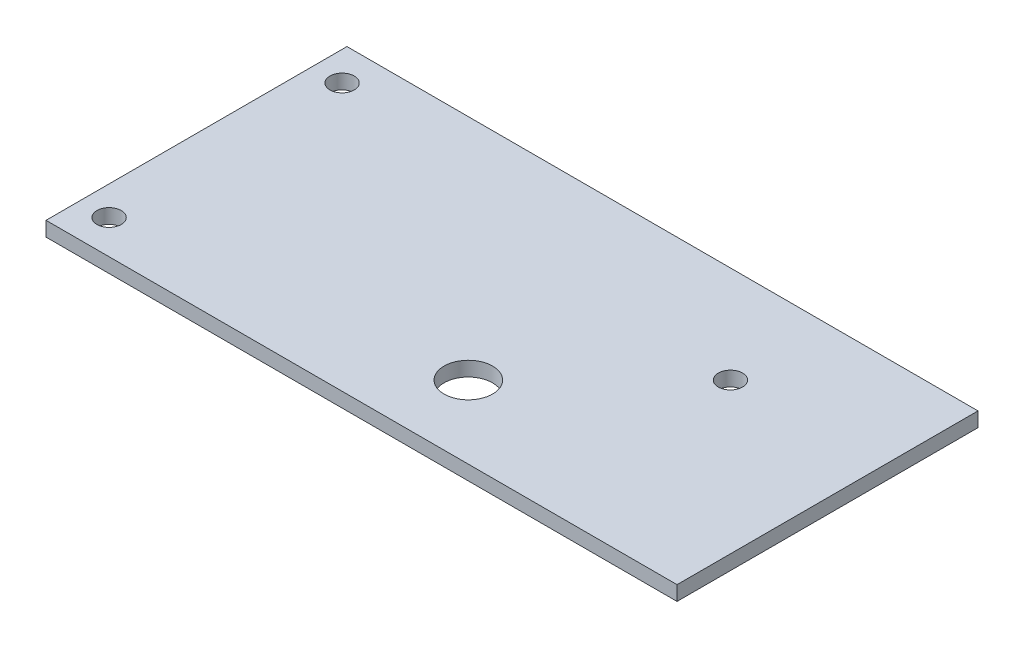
ISO-10303-21;
HEADER;
FILE_DESCRIPTION(('STEP AP214'),'2;1');
FILE_NAME('part.step','',(''),(''),'','','');
FILE_SCHEMA(('AUTOMOTIVE_DESIGN { 1 0 10303 214 1 1 1 1 }'));
ENDSEC;
DATA;
#1=APPLICATION_CONTEXT('core data for automotive mechanical design processes');
#2=APPLICATION_PROTOCOL_DEFINITION('international standard','automotive_design',2000,#1);
#3=PRODUCT_CONTEXT('',#1,'mechanical');
#4=PRODUCT('Part','Part','',(#3));
#5=PRODUCT_RELATED_PRODUCT_CATEGORY('part','',(#4));
#6=PRODUCT_DEFINITION_FORMATION('','',#4);
#7=PRODUCT_DEFINITION_CONTEXT('part definition',#1,'design');
#8=PRODUCT_DEFINITION('design','',#6,#7);
#9=PRODUCT_DEFINITION_SHAPE('','',#8);
#10=(LENGTH_UNIT() NAMED_UNIT(*) SI_UNIT(.MILLI.,.METRE.));
#11=(NAMED_UNIT(*) PLANE_ANGLE_UNIT() SI_UNIT($,.RADIAN.));
#12=(NAMED_UNIT(*) SI_UNIT($,.STERADIAN.) SOLID_ANGLE_UNIT());
#13=UNCERTAINTY_MEASURE_WITH_UNIT(LENGTH_MEASURE(1.E-05),#10,'distance_accuracy_value','');
#14=(GEOMETRIC_REPRESENTATION_CONTEXT(3) GLOBAL_UNCERTAINTY_ASSIGNED_CONTEXT((#13)) GLOBAL_UNIT_ASSIGNED_CONTEXT((#10,
#11,#12)) REPRESENTATION_CONTEXT('',''));
#15=CARTESIAN_POINT('',(0.,0.,0.));
#16=DIRECTION('',(0.,0.,1.));
#17=DIRECTION('',(1.,0.,0.));
#18=AXIS2_PLACEMENT_3D('',#15,#16,#17);
#19=CARTESIAN_POINT('',(0.,3.,-62.));
#20=DIRECTION('',(0.,-1.,0.));
#21=DIRECTION('',(0.,0.,-1.));
#22=AXIS2_PLACEMENT_3D('',#19,#20,#21);
#23=PLANE('',#22);
#24=CARTESIAN_POINT('',(6.00000000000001,3.,-55.));
#25=DIRECTION('',(0.,1.,0.));
#26=DIRECTION('',(0.,0.,1.));
#27=AXIS2_PLACEMENT_3D('',#24,#25,#26);
#28=CIRCLE('',#27,2.49999999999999);
#29=CARTESIAN_POINT('',(6.00000000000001,3.,-52.5));
#30=VERTEX_POINT('',#29);
#31=EDGE_CURVE('E130',#30,#30,#28,.T.);
#32=ORIENTED_EDGE('',*,*,#31,.F.);
#33=EDGE_LOOP('',(#32));
#34=FACE_BOUND('',#33,.T.);
#35=CARTESIAN_POINT('',(6.,3.,-7.));
#36=DIRECTION('',(0.,1.,0.));
#37=DIRECTION('',(0.,0.,1.));
#38=AXIS2_PLACEMENT_3D('',#35,#36,#37);
#39=CIRCLE('',#38,2.49999999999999);
#40=CARTESIAN_POINT('',(6.,3.,-4.50000000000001));
#41=VERTEX_POINT('',#40);
#42=EDGE_CURVE('E124',#41,#41,#39,.T.);
#43=ORIENTED_EDGE('',*,*,#42,.F.);
#44=EDGE_LOOP('',(#43));
#45=FACE_BOUND('',#44,.T.);
#46=CARTESIAN_POINT('',(72.,3.,-15.));
#47=DIRECTION('',(0.,1.,0.));
#48=DIRECTION('',(0.,0.,1.));
#49=AXIS2_PLACEMENT_3D('',#46,#47,#48);
#50=CIRCLE('',#49,5.);
#51=CARTESIAN_POINT('',(72.,3.,-9.99999999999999));
#52=VERTEX_POINT('',#51);
#53=EDGE_CURVE('E98',#52,#52,#50,.T.);
#54=ORIENTED_EDGE('',*,*,#53,.F.);
#55=EDGE_LOOP('',(#54));
#56=FACE_BOUND('',#55,.T.);
#57=DIRECTION('',(0.,0.,1.));
#58=VECTOR('',#57,1.);
#59=CARTESIAN_POINT('',(0.,3.,0.));
#60=LINE('',#59,#58);
#61=CARTESIAN_POINT('',(0.,3.,-62.));
#62=VERTEX_POINT('',#61);
#63=CARTESIAN_POINT('',(0.,3.,0.));
#64=VERTEX_POINT('',#63);
#65=EDGE_CURVE('E83',#62,#64,#60,.T.);
#66=ORIENTED_EDGE('',*,*,#65,.T.);
#67=DIRECTION('',(1.,0.,0.));
#68=VECTOR('',#67,1.);
#69=CARTESIAN_POINT('',(0.,3.,0.));
#70=LINE('',#69,#68);
#71=CARTESIAN_POINT('',(130.,3.,0.));
#72=VERTEX_POINT('',#71);
#73=EDGE_CURVE('E78',#64,#72,#70,.T.);
#74=ORIENTED_EDGE('',*,*,#73,.T.);
#75=DIRECTION('',(0.,0.,-1.));
#76=VECTOR('',#75,1.);
#77=CARTESIAN_POINT('',(130.,3.,0.));
#78=LINE('',#77,#76);
#79=CARTESIAN_POINT('',(130.,3.,-62.));
#80=VERTEX_POINT('',#79);
#81=EDGE_CURVE('E81',#72,#80,#78,.T.);
#82=ORIENTED_EDGE('',*,*,#81,.T.);
#83=DIRECTION('',(-1.,0.,0.));
#84=VECTOR('',#83,1.);
#85=CARTESIAN_POINT('',(0.,3.,-62.));
#86=LINE('',#85,#84);
#87=EDGE_CURVE('E48',#80,#62,#86,.T.);
#88=ORIENTED_EDGE('',*,*,#87,.T.);
#89=EDGE_LOOP('',(#66,#74,#82,#88));
#90=FACE_BOUND('',#89,.T.);
#91=CARTESIAN_POINT('',(99.,3.,-42.));
#92=DIRECTION('',(0.,1.,0.));
#93=DIRECTION('',(0.,0.,1.));
#94=AXIS2_PLACEMENT_3D('',#91,#92,#93);
#95=CIRCLE('',#94,2.49999999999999);
#96=CARTESIAN_POINT('',(99.,3.,-39.5));
#97=VERTEX_POINT('',#96);
#98=EDGE_CURVE('E118',#97,#97,#95,.T.);
#99=ORIENTED_EDGE('',*,*,#98,.F.);
#100=EDGE_LOOP('',(#99));
#101=FACE_BOUND('',#100,.T.);
#102=ADVANCED_FACE('F31',(#34,#45,#56,#90,#101),#23,.F.);
#103=CARTESIAN_POINT('',(0.,0.,-62.));
#104=DIRECTION('',(0.,-1.,0.));
#105=DIRECTION('',(0.,0.,-1.));
#106=AXIS2_PLACEMENT_3D('',#103,#104,#105);
#107=PLANE('',#106);
#108=CARTESIAN_POINT('',(6.00000000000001,0.,-55.));
#109=DIRECTION('',(0.,1.,0.));
#110=DIRECTION('',(0.,0.,1.));
#111=AXIS2_PLACEMENT_3D('',#108,#109,#110);
#112=CIRCLE('',#111,2.5);
#113=CARTESIAN_POINT('',(6.00000000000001,0.,-52.5));
#114=VERTEX_POINT('',#113);
#115=EDGE_CURVE('E127',#114,#114,#112,.T.);
#116=ORIENTED_EDGE('',*,*,#115,.T.);
#117=EDGE_LOOP('',(#116));
#118=FACE_BOUND('',#117,.T.);
#119=CARTESIAN_POINT('',(6.,0.,-7.));
#120=DIRECTION('',(0.,1.,0.));
#121=DIRECTION('',(0.,0.,1.));
#122=AXIS2_PLACEMENT_3D('',#119,#120,#121);
#123=CIRCLE('',#122,2.5);
#124=CARTESIAN_POINT('',(6.,0.,-4.5));
#125=VERTEX_POINT('',#124);
#126=EDGE_CURVE('E121',#125,#125,#123,.T.);
#127=ORIENTED_EDGE('',*,*,#126,.T.);
#128=EDGE_LOOP('',(#127));
#129=FACE_BOUND('',#128,.T.);
#130=CARTESIAN_POINT('',(72.,0.,-15.));
#131=DIRECTION('',(0.,1.,0.));
#132=DIRECTION('',(0.,0.,1.));
#133=AXIS2_PLACEMENT_3D('',#130,#131,#132);
#134=CIRCLE('',#133,5.);
#135=CARTESIAN_POINT('',(72.,0.,-9.99999999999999));
#136=VERTEX_POINT('',#135);
#137=EDGE_CURVE('E110',#136,#136,#134,.T.);
#138=ORIENTED_EDGE('',*,*,#137,.T.);
#139=EDGE_LOOP('',(#138));
#140=FACE_BOUND('',#139,.T.);
#141=DIRECTION('',(0.,0.,1.));
#142=VECTOR('',#141,1.);
#143=CARTESIAN_POINT('',(0.,0.,0.));
#144=LINE('',#143,#142);
#145=CARTESIAN_POINT('',(0.,0.,-62.));
#146=VERTEX_POINT('',#145);
#147=CARTESIAN_POINT('',(0.,0.,0.));
#148=VERTEX_POINT('',#147);
#149=EDGE_CURVE('E95',#146,#148,#144,.T.);
#150=ORIENTED_EDGE('',*,*,#149,.F.);
#151=DIRECTION('',(-1.,0.,0.));
#152=VECTOR('',#151,1.);
#153=CARTESIAN_POINT('',(0.,0.,-62.));
#154=LINE('',#153,#152);
#155=CARTESIAN_POINT('',(130.,0.,-62.));
#156=VERTEX_POINT('',#155);
#157=EDGE_CURVE('E71',#156,#146,#154,.T.);
#158=ORIENTED_EDGE('',*,*,#157,.F.);
#159=DIRECTION('',(0.,0.,-1.));
#160=VECTOR('',#159,1.);
#161=CARTESIAN_POINT('',(130.,0.,0.));
#162=LINE('',#161,#160);
#163=CARTESIAN_POINT('',(130.,0.,0.));
#164=VERTEX_POINT('',#163);
#165=EDGE_CURVE('E65',#164,#156,#162,.T.);
#166=ORIENTED_EDGE('',*,*,#165,.F.);
#167=DIRECTION('',(1.,0.,0.));
#168=VECTOR('',#167,1.);
#169=CARTESIAN_POINT('',(0.,0.,0.));
#170=LINE('',#169,#168);
#171=EDGE_CURVE('E87',#148,#164,#170,.T.);
#172=ORIENTED_EDGE('',*,*,#171,.F.);
#173=EDGE_LOOP('',(#150,#158,#166,#172));
#174=FACE_BOUND('',#173,.T.);
#175=CARTESIAN_POINT('',(99.,0.,-42.));
#176=DIRECTION('',(0.,1.,0.));
#177=DIRECTION('',(0.,0.,1.));
#178=AXIS2_PLACEMENT_3D('',#175,#176,#177);
#179=CIRCLE('',#178,2.5);
#180=CARTESIAN_POINT('',(99.,0.,-39.5));
#181=VERTEX_POINT('',#180);
#182=EDGE_CURVE('E113',#181,#181,#179,.T.);
#183=ORIENTED_EDGE('',*,*,#182,.T.);
#184=EDGE_LOOP('',(#183));
#185=FACE_BOUND('',#184,.T.);
#186=ADVANCED_FACE('F106',(#118,#129,#140,#174,#185),#107,.T.);
#187=CARTESIAN_POINT('',(0.,3.,0.));
#188=DIRECTION('',(1.,0.,0.));
#189=DIRECTION('',(0.,0.,-1.));
#190=AXIS2_PLACEMENT_3D('',#187,#188,#189);
#191=PLANE('',#190);
#192=ORIENTED_EDGE('',*,*,#149,.T.);
#193=DIRECTION('',(0.,-1.,0.));
#194=VECTOR('',#193,1.);
#195=CARTESIAN_POINT('',(0.,3.,0.));
#196=LINE('',#195,#194);
#197=EDGE_CURVE('E11',#64,#148,#196,.T.);
#198=ORIENTED_EDGE('',*,*,#197,.F.);
#199=ORIENTED_EDGE('',*,*,#65,.F.);
#200=DIRECTION('',(0.,-1.,0.));
#201=VECTOR('',#200,1.);
#202=CARTESIAN_POINT('',(0.,3.,-62.));
#203=LINE('',#202,#201);
#204=EDGE_CURVE('E91',#62,#146,#203,.T.);
#205=ORIENTED_EDGE('',*,*,#204,.T.);
#206=EDGE_LOOP('',(#192,#198,#199,#205));
#207=FACE_BOUND('',#206,.T.);
#208=ADVANCED_FACE('F33',(#207),#191,.F.);
#209=CARTESIAN_POINT('',(0.,3.,0.));
#210=DIRECTION('',(0.,0.,-1.));
#211=DIRECTION('',(-1.,0.,0.));
#212=AXIS2_PLACEMENT_3D('',#209,#210,#211);
#213=PLANE('',#212);
#214=ORIENTED_EDGE('',*,*,#171,.T.);
#215=DIRECTION('',(0.,-1.,0.));
#216=VECTOR('',#215,1.);
#217=CARTESIAN_POINT('',(130.,3.,0.));
#218=LINE('',#217,#216);
#219=EDGE_CURVE('E40',#72,#164,#218,.T.);
#220=ORIENTED_EDGE('',*,*,#219,.F.);
#221=ORIENTED_EDGE('',*,*,#73,.F.);
#222=ORIENTED_EDGE('',*,*,#197,.T.);
#223=EDGE_LOOP('',(#214,#220,#221,#222));
#224=FACE_BOUND('',#223,.T.);
#225=ADVANCED_FACE('F86',(#224),#213,.F.);
#226=CARTESIAN_POINT('',(130.,3.,0.));
#227=DIRECTION('',(-1.,0.,0.));
#228=DIRECTION('',(0.,0.,1.));
#229=AXIS2_PLACEMENT_3D('',#226,#227,#228);
#230=PLANE('',#229);
#231=ORIENTED_EDGE('',*,*,#165,.T.);
#232=DIRECTION('',(0.,-1.,0.));
#233=VECTOR('',#232,1.);
#234=CARTESIAN_POINT('',(130.,3.,-62.));
#235=LINE('',#234,#233);
#236=EDGE_CURVE('E88',#80,#156,#235,.T.);
#237=ORIENTED_EDGE('',*,*,#236,.F.);
#238=ORIENTED_EDGE('',*,*,#81,.F.);
#239=ORIENTED_EDGE('',*,*,#219,.T.);
#240=EDGE_LOOP('',(#231,#237,#238,#239));
#241=FACE_BOUND('',#240,.T.);
#242=ADVANCED_FACE('F89',(#241),#230,.F.);
#243=CARTESIAN_POINT('',(0.,3.,-62.));
#244=DIRECTION('',(0.,0.,1.));
#245=DIRECTION('',(1.,0.,0.));
#246=AXIS2_PLACEMENT_3D('',#243,#244,#245);
#247=PLANE('',#246);
#248=ORIENTED_EDGE('',*,*,#157,.T.);
#249=ORIENTED_EDGE('',*,*,#204,.F.);
#250=ORIENTED_EDGE('',*,*,#87,.F.);
#251=ORIENTED_EDGE('',*,*,#236,.T.);
#252=EDGE_LOOP('',(#248,#249,#250,#251));
#253=FACE_BOUND('',#252,.T.);
#254=ADVANCED_FACE('F103',(#253),#247,.F.);
#255=CARTESIAN_POINT('',(72.,3.,-15.));
#256=DIRECTION('',(0.,-1.,0.));
#257=DIRECTION('',(0.,0.,-1.));
#258=AXIS2_PLACEMENT_3D('',#255,#256,#257);
#259=CYLINDRICAL_SURFACE('',#258,5.);
#260=ORIENTED_EDGE('',*,*,#53,.T.);
#261=EDGE_LOOP('',(#260));
#262=FACE_BOUND('',#261,.T.);
#263=ORIENTED_EDGE('',*,*,#137,.F.);
#264=EDGE_LOOP('',(#263));
#265=FACE_BOUND('',#264,.T.);
#266=ADVANCED_FACE('F143',(#262,#265),#259,.F.);
#267=CARTESIAN_POINT('',(99.,3.,-42.));
#268=DIRECTION('',(0.,1.,0.));
#269=DIRECTION('',(0.,0.,1.));
#270=AXIS2_PLACEMENT_3D('',#267,#268,#269);
#271=CYLINDRICAL_SURFACE('',#270,2.5);
#272=ORIENTED_EDGE('',*,*,#182,.F.);
#273=EDGE_LOOP('',(#272));
#274=FACE_BOUND('',#273,.T.);
#275=ORIENTED_EDGE('',*,*,#98,.T.);
#276=EDGE_LOOP('',(#275));
#277=FACE_BOUND('',#276,.T.);
#278=ADVANCED_FACE('F146',(#274,#277),#271,.F.);
#279=CARTESIAN_POINT('',(6.,3.,-7.));
#280=DIRECTION('',(0.,1.,0.));
#281=DIRECTION('',(0.,0.,1.));
#282=AXIS2_PLACEMENT_3D('',#279,#280,#281);
#283=CYLINDRICAL_SURFACE('',#282,2.49999999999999);
#284=ORIENTED_EDGE('',*,*,#126,.F.);
#285=EDGE_LOOP('',(#284));
#286=FACE_BOUND('',#285,.T.);
#287=ORIENTED_EDGE('',*,*,#42,.T.);
#288=EDGE_LOOP('',(#287));
#289=FACE_BOUND('',#288,.T.);
#290=ADVANCED_FACE('F185',(#286,#289),#283,.F.);
#291=CARTESIAN_POINT('',(6.00000000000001,3.,-55.));
#292=DIRECTION('',(0.,1.,0.));
#293=DIRECTION('',(0.,0.,1.));
#294=AXIS2_PLACEMENT_3D('',#291,#292,#293);
#295=CYLINDRICAL_SURFACE('',#294,2.49999999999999);
#296=ORIENTED_EDGE('',*,*,#115,.F.);
#297=EDGE_LOOP('',(#296));
#298=FACE_BOUND('',#297,.T.);
#299=ORIENTED_EDGE('',*,*,#31,.T.);
#300=EDGE_LOOP('',(#299));
#301=FACE_BOUND('',#300,.T.);
#302=ADVANCED_FACE('F134',(#298,#301),#295,.F.);
#303=CLOSED_SHELL('',(#102,#186,#208,#225,#242,#254,#266,#278,#290,#302));
#304=MANIFOLD_SOLID_BREP('B2',#303);
#305=ADVANCED_BREP_SHAPE_REPRESENTATION('',(#18,#304),#14);
#306=SHAPE_DEFINITION_REPRESENTATION(#9,#305);
ENDSEC;
END-ISO-10303-21;
